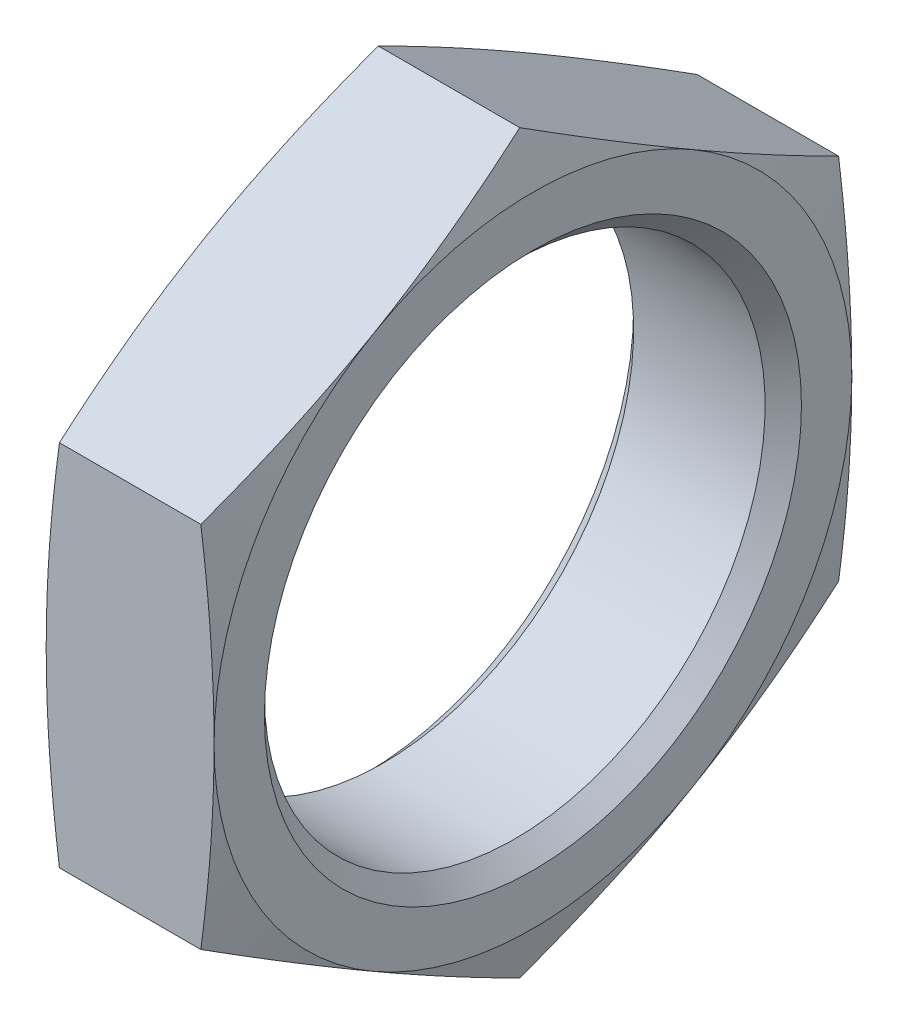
ISO-10303-21;
HEADER;
FILE_DESCRIPTION(('STEP AP214'),'2;1');
FILE_NAME('part.step','',(''),(''),'','','');
FILE_SCHEMA(('AUTOMOTIVE_DESIGN { 1 0 10303 214 1 1 1 1 }'));
ENDSEC;
DATA;
#1=APPLICATION_CONTEXT('core data for automotive mechanical design processes');
#2=APPLICATION_PROTOCOL_DEFINITION('international standard','automotive_design',2000,#1);
#3=PRODUCT_CONTEXT('',#1,'mechanical');
#4=PRODUCT('Part','Part','',(#3));
#5=PRODUCT_RELATED_PRODUCT_CATEGORY('part','',(#4));
#6=PRODUCT_DEFINITION_FORMATION('','',#4);
#7=PRODUCT_DEFINITION_CONTEXT('part definition',#1,'design');
#8=PRODUCT_DEFINITION('design','',#6,#7);
#9=PRODUCT_DEFINITION_SHAPE('','',#8);
#10=(LENGTH_UNIT() NAMED_UNIT(*) SI_UNIT(.MILLI.,.METRE.));
#11=(NAMED_UNIT(*) PLANE_ANGLE_UNIT() SI_UNIT($,.RADIAN.));
#12=(NAMED_UNIT(*) SI_UNIT($,.STERADIAN.) SOLID_ANGLE_UNIT());
#13=UNCERTAINTY_MEASURE_WITH_UNIT(LENGTH_MEASURE(1.E-05),#10,'distance_accuracy_value','');
#14=(GEOMETRIC_REPRESENTATION_CONTEXT(3) GLOBAL_UNCERTAINTY_ASSIGNED_CONTEXT((#13)) GLOBAL_UNIT_ASSIGNED_CONTEXT((#10,
#11,#12)) REPRESENTATION_CONTEXT('',''));
#15=CARTESIAN_POINT('',(0.,0.,0.));
#16=DIRECTION('',(0.,0.,1.));
#17=DIRECTION('',(1.,0.,0.));
#18=AXIS2_PLACEMENT_3D('',#15,#16,#17);
#19=CARTESIAN_POINT('',(1.0182069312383,0.,0.));
#20=DIRECTION('',(1.,0.,0.));
#21=DIRECTION('',(0.,0.,-1.));
#22=AXIS2_PLACEMENT_3D('',#19,#20,#21);
#23=CONICAL_SURFACE('',#22,13.3,1.30899693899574);
#24=CARTESIAN_POINT('',(0.393823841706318,-5.48471208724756,-9.5002));
#25=CARTESIAN_POINT('',(0.332765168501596,-5.71249277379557,-9.10567227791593));
#26=CARTESIAN_POINT('',(0.277334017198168,-5.94068644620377,-8.71042924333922));
#27=CARTESIAN_POINT('',(0.179946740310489,-6.39787965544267,-7.918547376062));
#28=CARTESIAN_POINT('',(0.137996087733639,-6.62687948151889,-7.52190804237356));
#29=CARTESIAN_POINT('',(0.0700188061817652,-7.08429660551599,-6.72963834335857));
#30=CARTESIAN_POINT('',(0.0439111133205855,-7.31271081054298,-6.33401333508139));
#31=CARTESIAN_POINT('',(0.00890337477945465,-7.76983049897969,-5.54225880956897));
#32=CARTESIAN_POINT('',(0.,-7.99853591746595,-5.14612940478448));
#33=CARTESIAN_POINT('',(0.,-8.45594675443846,-4.35387059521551));
#34=CARTESIAN_POINT('',(0.00890337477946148,-8.68465217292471,-3.95774119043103));
#35=CARTESIAN_POINT('',(0.043911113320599,-9.14177186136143,-3.16598666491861));
#36=CARTESIAN_POINT('',(0.070018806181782,-9.37018606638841,-2.77036165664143));
#37=CARTESIAN_POINT('',(0.137996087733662,-9.82760319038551,-1.97809195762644));
#38=CARTESIAN_POINT('',(0.179946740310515,-10.0566030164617,-1.581452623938));
#39=CARTESIAN_POINT('',(0.277334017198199,-10.5137962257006,-0.789570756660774));
#40=CARTESIAN_POINT('',(0.33276516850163,-10.7419898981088,-0.394327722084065));
#41=CARTESIAN_POINT('',(0.393823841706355,-10.9697705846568,0.000200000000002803));
#42=B_SPLINE_CURVE_WITH_KNOTS('',3,(#24,#25,#26,#27,#28,#29,#30,#31,#32,#33,#34,#35,#36,#37,#38,
#39,#40,#41),.UNSPECIFIED.,.F.,.F.,(4,2,2,2,2,2,2,2,4),(0.,1.3789772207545,2.75851359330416,
4.13093041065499,5.50308163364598,6.87523285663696,8.24764967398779,9.62718604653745,
11.006163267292),.UNSPECIFIED.);
#43=CARTESIAN_POINT('',(0.,-8.22724133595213,-4.75000000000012));
#44=VERTEX_POINT('',#43);
#45=CARTESIAN_POINT('',(0.393792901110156,-10.969655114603,0.));
#46=VERTEX_POINT('',#45);
#47=EDGE_CURVE('E200',#44,#46,#42,.T.);
#48=ORIENTED_EDGE('',*,*,#47,.T.);
#49=CARTESIAN_POINT('',(0.393823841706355,-10.9697705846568,-0.000199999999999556));
#50=CARTESIAN_POINT('',(0.33276516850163,-10.7419898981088,0.394327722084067));
#51=CARTESIAN_POINT('',(0.277334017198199,-10.5137962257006,0.789570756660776));
#52=CARTESIAN_POINT('',(0.179946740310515,-10.0566030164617,1.581452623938));
#53=CARTESIAN_POINT('',(0.137996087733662,-9.82760319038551,1.97809195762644));
#54=CARTESIAN_POINT('',(0.0700188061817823,-9.37018606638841,2.77036165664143));
#55=CARTESIAN_POINT('',(0.0439111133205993,-9.14177186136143,3.16598666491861));
#56=CARTESIAN_POINT('',(0.00890337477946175,-8.68465217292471,3.95774119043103));
#57=CARTESIAN_POINT('',(0.,-8.45594675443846,4.35387059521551));
#58=CARTESIAN_POINT('',(0.,-7.99853591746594,5.14612940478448));
#59=CARTESIAN_POINT('',(0.0089033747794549,-7.76983049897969,5.54225880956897));
#60=CARTESIAN_POINT('',(0.0439111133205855,-7.31271081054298,6.33401333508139));
#61=CARTESIAN_POINT('',(0.0700188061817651,-7.084296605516,6.72963834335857));
#62=CARTESIAN_POINT('',(0.137996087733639,-6.62687948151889,7.52190804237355));
#63=CARTESIAN_POINT('',(0.179946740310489,-6.39787965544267,7.918547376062));
#64=CARTESIAN_POINT('',(0.277334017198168,-5.94068644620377,8.71042924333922));
#65=CARTESIAN_POINT('',(0.332765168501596,-5.71249277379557,9.10567227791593));
#66=CARTESIAN_POINT('',(0.393823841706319,-5.48471208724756,9.5002));
#67=B_SPLINE_CURVE_WITH_KNOTS('',3,(#49,#50,#51,#52,#53,#54,#55,#56,#57,#58,#59,#60,#61,#62,#63,
#64,#65,#66),.UNSPECIFIED.,.F.,.F.,(4,2,2,2,2,2,2,2,4),(0.,1.3789772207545,2.75851359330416,
4.13093041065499,5.50308163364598,6.87523285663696,8.24764967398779,9.62718604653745,
11.006163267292),.UNSPECIFIED.);
#68=CARTESIAN_POINT('',(0.,-8.22724133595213,4.75000000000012));
#69=VERTEX_POINT('',#68);
#70=EDGE_CURVE('E218',#46,#69,#67,.T.);
#71=ORIENTED_EDGE('',*,*,#70,.T.);
#72=CARTESIAN_POINT('',(0.,0.,0.));
#73=DIRECTION('',(-1.,0.,0.));
#74=DIRECTION('',(0.,0.,1.));
#75=AXIS2_PLACEMENT_3D('',#72,#73,#74);
#76=CIRCLE('',#75,9.5);
#77=EDGE_CURVE('E278',#44,#69,#76,.T.);
#78=ORIENTED_EDGE('',*,*,#77,.F.);
#79=EDGE_LOOP('',(#48,#71,#78));
#80=FACE_BOUND('',#79,.T.);
#81=ADVANCED_FACE('F31',(#80),#23,.T.);
#82=CARTESIAN_POINT('',(0.,0.,9.5));
#83=VERTEX_POINT('',#82);
#84=EDGE_CURVE('E154',#69,#83,#76,.T.);
#85=ORIENTED_EDGE('',*,*,#84,.F.);
#86=CARTESIAN_POINT('',(0.39379290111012,-5.4848275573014,9.5));
#87=VERTEX_POINT('',#86);
#88=EDGE_CURVE('E205',#69,#87,#67,.T.);
#89=ORIENTED_EDGE('',*,*,#88,.T.);
#90=CARTESIAN_POINT('',(2.10970374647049,-14.5461077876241,9.5));
#91=CARTESIAN_POINT('',(2.01294628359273,-14.1146987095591,9.5));
#92=CARTESIAN_POINT('',(1.91736604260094,-13.6830208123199,9.5));
#93=CARTESIAN_POINT('',(1.72919550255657,-12.8189952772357,9.5));
#94=CARTESIAN_POINT('',(1.636605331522,-12.3866476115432,9.5));
#95=CARTESIAN_POINT('',(1.4549709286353,-11.5207683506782,9.5));
#96=CARTESIAN_POINT('',(1.36593021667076,-11.0872360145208,9.5));
#97=CARTESIAN_POINT('',(1.19234995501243,-10.2192716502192,9.5));
#98=CARTESIAN_POINT('',(1.10781036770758,-9.78483962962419,9.5));
#99=CARTESIAN_POINT('',(0.944956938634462,-8.91838541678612,9.5));
#100=CARTESIAN_POINT('',(0.866598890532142,-8.48637157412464,9.5));
#101=CARTESIAN_POINT('',(0.716681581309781,-7.62115649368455,9.5));
#102=CARTESIAN_POINT('',(0.64512234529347,-7.18795525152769,9.5));
#103=CARTESIAN_POINT('',(0.510409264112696,-6.32029337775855,9.5));
#104=CARTESIAN_POINT('',(0.447254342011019,-5.88583291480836,9.5));
#105=CARTESIAN_POINT('',(0.331203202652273,-5.0155282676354,9.5));
#106=CARTESIAN_POINT('',(0.278306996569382,-4.57968408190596,9.5));
#107=CARTESIAN_POINT('',(0.184263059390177,-3.70167921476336,9.5));
#108=CARTESIAN_POINT('',(0.143256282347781,-3.25950320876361,9.5));
#109=CARTESIAN_POINT('',(0.0758152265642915,-2.37403164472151,9.5));
#110=CARTESIAN_POINT('',(0.0493806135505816,-1.93073611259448,9.5));
#111=CARTESIAN_POINT('',(0.0126252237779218,-1.04366969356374,9.5));
#112=CARTESIAN_POINT('',(0.00229698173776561,-0.599899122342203,9.5));
#113=CARTESIAN_POINT('',(-0.00160982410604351,0.287716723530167,9.5));
#114=CARTESIAN_POINT('',(0.00481159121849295,0.731561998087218,9.5));
#115=CARTESIAN_POINT('',(0.0340433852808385,1.62032305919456,9.5));
#116=CARTESIAN_POINT('',(0.0569134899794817,2.06523684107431,9.5));
#117=CARTESIAN_POINT('',(0.117733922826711,2.95402294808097,9.5));
#118=CARTESIAN_POINT('',(0.155684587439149,3.39789524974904,9.5));
#119=CARTESIAN_POINT('',(0.244740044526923,4.2845939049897,9.5));
#120=CARTESIAN_POINT('',(0.295853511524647,4.72741937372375,9.5));
#121=CARTESIAN_POINT('',(0.409096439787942,5.61164372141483,9.5));
#122=CARTESIAN_POINT('',(0.471225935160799,6.0530425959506,9.5));
#123=CARTESIAN_POINT('',(0.600579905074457,6.90851654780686,9.5));
#124=CARTESIAN_POINT('',(0.667289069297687,7.32267033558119,9.5));
#125=CARTESIAN_POINT('',(0.807250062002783,8.14987638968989,9.5));
#126=CARTESIAN_POINT('',(0.880502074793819,8.56292862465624,9.5));
#127=CARTESIAN_POINT('',(1.03234492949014,9.38809006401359,9.5));
#128=CARTESIAN_POINT('',(1.11093632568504,9.80019916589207,9.5));
#129=CARTESIAN_POINT('',(1.27246601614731,10.6235574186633,9.5));
#130=CARTESIAN_POINT('',(1.3554042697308,11.0348065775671,9.5));
#131=CARTESIAN_POINT('',(1.5248571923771,11.8566718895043,9.5));
#132=CARTESIAN_POINT('',(1.61137274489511,12.2672878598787,9.5));
#133=CARTESIAN_POINT('',(1.78733417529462,13.0878923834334,9.5));
#134=CARTESIAN_POINT('',(1.87678007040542,13.4978809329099,9.5));
#135=CARTESIAN_POINT('',(2.14871662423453,14.7269901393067,9.5));
#136=CARTESIAN_POINT('',(2.33481810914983,15.5453115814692,9.5));
#137=CARTESIAN_POINT('',(2.71184671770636,17.1723071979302,9.5));
#138=CARTESIAN_POINT('',(2.90270792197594,17.9809967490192,9.5));
#139=CARTESIAN_POINT('',(3.28919263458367,19.597251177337,9.5));
#140=CARTESIAN_POINT('',(3.48481623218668,20.4048160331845,9.5));
#141=CARTESIAN_POINT('',(3.87932308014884,22.0180679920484,9.5));
#142=CARTESIAN_POINT('',(4.07820190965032,22.8237561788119,9.5));
#143=CARTESIAN_POINT('',(4.47865639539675,24.434433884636,9.5));
#144=CARTESIAN_POINT('',(4.68023196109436,25.2394234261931,9.5));
#145=CARTESIAN_POINT('',(4.88276117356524,26.0441702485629,9.5));
#146=B_SPLINE_CURVE_WITH_KNOTS('',3,(#90,#91,#92,#93,#94,#95,#96,#97,#98,#99,#100,#101,#102,
#103,#104,#105,#106,#107,#108,#109,#110,#111,#112,#113,#114,#115,#116,#117,#118,#119,#120,#121,
#122,#123,#124,#125,#126,#127,#128,#129,#130,#131,#132,#133,#134,#135,#136,#137,#138,#139,#140,
#141,#142,#143,#144,#145),.UNSPECIFIED.,.F.,.F.,(4,2,2,2,2,2,2,2,2,2,2,2,2,2,2,2,2,2,2,2,2,2,2,
2,2,2,2,4),(0.,1.3263847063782,2.65282612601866,3.98055177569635,5.30826632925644,
6.6254106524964,7.9425598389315,9.25954008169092,10.5765217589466,11.9085319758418,
13.2405116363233,14.5718737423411,15.9032341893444,17.2394534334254,18.575702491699,
19.9128344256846,21.2499704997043,22.5083841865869,23.7668333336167,25.0254133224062,
26.2839815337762,27.5428624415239,28.80175075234,31.3193519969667,33.8120568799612,
36.3048085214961,38.7944172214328,41.2839425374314),.UNSPECIFIED.);
#147=EDGE_CURVE('E217',#87,#83,#146,.T.);
#148=ORIENTED_EDGE('',*,*,#147,.T.);
#149=EDGE_LOOP('',(#85,#89,#148));
#150=FACE_BOUND('',#149,.T.);
#151=ADVANCED_FACE('F266',(#150),#23,.T.);
#152=CARTESIAN_POINT('',(0.,8.22724133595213,4.75000000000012));
#153=VERTEX_POINT('',#152);
#154=EDGE_CURVE('E152',#83,#153,#76,.T.);
#155=ORIENTED_EDGE('',*,*,#154,.F.);
#156=CARTESIAN_POINT('',(0.39379290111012,5.4848275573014,9.5));
#157=VERTEX_POINT('',#156);
#158=EDGE_CURVE('E211',#83,#157,#146,.T.);
#159=ORIENTED_EDGE('',*,*,#158,.T.);
#160=CARTESIAN_POINT('',(0.393823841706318,5.48471208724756,9.5002));
#161=CARTESIAN_POINT('',(0.332765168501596,5.71249277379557,9.10567227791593));
#162=CARTESIAN_POINT('',(0.277334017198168,5.94068644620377,8.71042924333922));
#163=CARTESIAN_POINT('',(0.179946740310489,6.39787965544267,7.918547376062));
#164=CARTESIAN_POINT('',(0.137996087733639,6.62687948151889,7.52190804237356));
#165=CARTESIAN_POINT('',(0.0700188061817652,7.08429660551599,6.72963834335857));
#166=CARTESIAN_POINT('',(0.0439111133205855,7.31271081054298,6.33401333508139));
#167=CARTESIAN_POINT('',(0.00890337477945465,7.76983049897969,5.54225880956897));
#168=CARTESIAN_POINT('',(0.,7.99853591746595,5.14612940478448));
#169=CARTESIAN_POINT('',(0.,8.45594675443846,4.35387059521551));
#170=CARTESIAN_POINT('',(0.00890337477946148,8.68465217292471,3.95774119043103));
#171=CARTESIAN_POINT('',(0.043911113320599,9.14177186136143,3.16598666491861));
#172=CARTESIAN_POINT('',(0.070018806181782,9.37018606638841,2.77036165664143));
#173=CARTESIAN_POINT('',(0.137996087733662,9.82760319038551,1.97809195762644));
#174=CARTESIAN_POINT('',(0.179946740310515,10.0566030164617,1.581452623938));
#175=CARTESIAN_POINT('',(0.277334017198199,10.5137962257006,0.789570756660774));
#176=CARTESIAN_POINT('',(0.33276516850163,10.7419898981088,0.394327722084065));
#177=CARTESIAN_POINT('',(0.393823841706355,10.9697705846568,-0.000200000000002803));
#178=B_SPLINE_CURVE_WITH_KNOTS('',3,(#160,#161,#162,#163,#164,#165,#166,#167,#168,#169,#170,
#171,#172,#173,#174,#175,#176,#177),.UNSPECIFIED.,.F.,.F.,(4,2,2,2,2,2,2,2,4),(0.,
1.3789772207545,2.75851359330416,4.13093041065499,5.50308163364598,6.87523285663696,
8.24764967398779,9.62718604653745,11.006163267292),.UNSPECIFIED.);
#179=EDGE_CURVE('E305',#157,#153,#178,.T.);
#180=ORIENTED_EDGE('',*,*,#179,.T.);
#181=EDGE_LOOP('',(#155,#159,#180));
#182=FACE_BOUND('',#181,.T.);
#183=ADVANCED_FACE('F271',(#182),#23,.T.);
#184=CARTESIAN_POINT('',(2.10970374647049,-14.5461077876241,-9.5));
#185=CARTESIAN_POINT('',(2.01294628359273,-14.1146987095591,-9.5));
#186=CARTESIAN_POINT('',(1.91736604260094,-13.6830208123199,-9.5));
#187=CARTESIAN_POINT('',(1.72919550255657,-12.8189952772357,-9.5));
#188=CARTESIAN_POINT('',(1.636605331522,-12.3866476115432,-9.5));
#189=CARTESIAN_POINT('',(1.4549709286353,-11.5207683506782,-9.5));
#190=CARTESIAN_POINT('',(1.36593021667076,-11.0872360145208,-9.5));
#191=CARTESIAN_POINT('',(1.19234995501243,-10.2192716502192,-9.5));
#192=CARTESIAN_POINT('',(1.10781036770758,-9.78483962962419,-9.5));
#193=CARTESIAN_POINT('',(0.944956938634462,-8.91838541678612,-9.5));
#194=CARTESIAN_POINT('',(0.866598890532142,-8.48637157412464,-9.5));
#195=CARTESIAN_POINT('',(0.716681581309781,-7.62115649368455,-9.5));
#196=CARTESIAN_POINT('',(0.64512234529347,-7.18795525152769,-9.5));
#197=CARTESIAN_POINT('',(0.510409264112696,-6.32029337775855,-9.5));
#198=CARTESIAN_POINT('',(0.447254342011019,-5.88583291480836,-9.5));
#199=CARTESIAN_POINT('',(0.331203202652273,-5.0155282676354,-9.5));
#200=CARTESIAN_POINT('',(0.278306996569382,-4.57968408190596,-9.5));
#201=CARTESIAN_POINT('',(0.184263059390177,-3.70167921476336,-9.5));
#202=CARTESIAN_POINT('',(0.143256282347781,-3.25950320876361,-9.5));
#203=CARTESIAN_POINT('',(0.0758152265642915,-2.37403164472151,-9.5));
#204=CARTESIAN_POINT('',(0.0493806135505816,-1.93073611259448,-9.5));
#205=CARTESIAN_POINT('',(0.0126252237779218,-1.04366969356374,-9.5));
#206=CARTESIAN_POINT('',(0.00229698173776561,-0.599899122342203,-9.5));
#207=CARTESIAN_POINT('',(-0.00160982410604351,0.287716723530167,-9.5));
#208=CARTESIAN_POINT('',(0.00481159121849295,0.731561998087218,-9.5));
#209=CARTESIAN_POINT('',(0.0340433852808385,1.62032305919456,-9.5));
#210=CARTESIAN_POINT('',(0.0569134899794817,2.06523684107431,-9.5));
#211=CARTESIAN_POINT('',(0.117733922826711,2.95402294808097,-9.5));
#212=CARTESIAN_POINT('',(0.155684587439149,3.39789524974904,-9.5));
#213=CARTESIAN_POINT('',(0.244740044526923,4.2845939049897,-9.5));
#214=CARTESIAN_POINT('',(0.295853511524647,4.72741937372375,-9.5));
#215=CARTESIAN_POINT('',(0.409096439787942,5.61164372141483,-9.5));
#216=CARTESIAN_POINT('',(0.471225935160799,6.0530425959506,-9.5));
#217=CARTESIAN_POINT('',(0.600579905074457,6.90851654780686,-9.5));
#218=CARTESIAN_POINT('',(0.667289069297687,7.32267033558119,-9.5));
#219=CARTESIAN_POINT('',(0.807250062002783,8.14987638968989,-9.5));
#220=CARTESIAN_POINT('',(0.880502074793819,8.56292862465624,-9.5));
#221=CARTESIAN_POINT('',(1.03234492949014,9.38809006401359,-9.5));
#222=CARTESIAN_POINT('',(1.11093632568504,9.80019916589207,-9.5));
#223=CARTESIAN_POINT('',(1.27246601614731,10.6235574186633,-9.5));
#224=CARTESIAN_POINT('',(1.3554042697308,11.0348065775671,-9.5));
#225=CARTESIAN_POINT('',(1.5248571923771,11.8566718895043,-9.5));
#226=CARTESIAN_POINT('',(1.61137274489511,12.2672878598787,-9.5));
#227=CARTESIAN_POINT('',(1.78733417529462,13.0878923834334,-9.5));
#228=CARTESIAN_POINT('',(1.87678007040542,13.4978809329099,-9.5));
#229=CARTESIAN_POINT('',(2.14871662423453,14.7269901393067,-9.5));
#230=CARTESIAN_POINT('',(2.33481810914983,15.5453115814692,-9.5));
#231=CARTESIAN_POINT('',(2.71184671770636,17.1723071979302,-9.5));
#232=CARTESIAN_POINT('',(2.90270792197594,17.9809967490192,-9.5));
#233=CARTESIAN_POINT('',(3.28919263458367,19.597251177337,-9.5));
#234=CARTESIAN_POINT('',(3.48481623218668,20.4048160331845,-9.5));
#235=CARTESIAN_POINT('',(3.87932308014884,22.0180679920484,-9.5));
#236=CARTESIAN_POINT('',(4.07820190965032,22.8237561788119,-9.5));
#237=CARTESIAN_POINT('',(4.47865639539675,24.434433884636,-9.5));
#238=CARTESIAN_POINT('',(4.68023196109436,25.2394234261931,-9.5));
#239=CARTESIAN_POINT('',(4.88276117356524,26.0441702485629,-9.5));
#240=B_SPLINE_CURVE_WITH_KNOTS('',3,(#184,#185,#186,#187,#188,#189,#190,#191,#192,#193,#194,
#195,#196,#197,#198,#199,#200,#201,#202,#203,#204,#205,#206,#207,#208,#209,#210,#211,#212,#213,
#214,#215,#216,#217,#218,#219,#220,#221,#222,#223,#224,#225,#226,#227,#228,#229,#230,#231,#232,
#233,#234,#235,#236,#237,#238,#239),.UNSPECIFIED.,.F.,.F.,(4,2,2,2,2,2,2,2,2,2,2,2,2,2,2,2,2,2,
2,2,2,2,2,2,2,2,2,4),(0.,1.3263847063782,2.65282612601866,3.98055177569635,5.30826632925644,
6.6254106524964,7.9425598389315,9.25954008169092,10.5765217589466,11.9085319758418,
13.2405116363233,14.5718737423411,15.9032341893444,17.2394534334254,18.575702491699,
19.9128344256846,21.2499704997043,22.5083841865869,23.7668333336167,25.0254133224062,
26.2839815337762,27.5428624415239,28.80175075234,31.3193519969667,33.8120568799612,
36.3048085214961,38.7944172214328,41.2839425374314),.UNSPECIFIED.);
#241=CARTESIAN_POINT('',(0.,0.,-9.5));
#242=VERTEX_POINT('',#241);
#243=CARTESIAN_POINT('',(0.39379290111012,-5.4848275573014,-9.5));
#244=VERTEX_POINT('',#243);
#245=EDGE_CURVE('E139',#242,#244,#240,.F.);
#246=ORIENTED_EDGE('',*,*,#245,.T.);
#247=EDGE_CURVE('E281',#244,#44,#42,.T.);
#248=ORIENTED_EDGE('',*,*,#247,.T.);
#249=EDGE_CURVE('E147',#242,#44,#76,.T.);
#250=ORIENTED_EDGE('',*,*,#249,.F.);
#251=EDGE_LOOP('',(#246,#248,#250));
#252=FACE_BOUND('',#251,.T.);
#253=ADVANCED_FACE('F284',(#252),#23,.T.);
#254=CARTESIAN_POINT('',(0.,8.22724133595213,-4.75000000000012));
#255=VERTEX_POINT('',#254);
#256=EDGE_CURVE('E136',#153,#255,#76,.T.);
#257=ORIENTED_EDGE('',*,*,#256,.F.);
#258=CARTESIAN_POINT('',(0.393792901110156,10.969655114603,0.));
#259=VERTEX_POINT('',#258);
#260=EDGE_CURVE('E138',#153,#259,#178,.T.);
#261=ORIENTED_EDGE('',*,*,#260,.T.);
#262=CARTESIAN_POINT('',(0.393823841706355,10.9697705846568,0.000199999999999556));
#263=CARTESIAN_POINT('',(0.33276516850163,10.7419898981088,-0.394327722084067));
#264=CARTESIAN_POINT('',(0.277334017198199,10.5137962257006,-0.789570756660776));
#265=CARTESIAN_POINT('',(0.179946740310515,10.0566030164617,-1.581452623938));
#266=CARTESIAN_POINT('',(0.137996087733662,9.82760319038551,-1.97809195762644));
#267=CARTESIAN_POINT('',(0.0700188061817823,9.37018606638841,-2.77036165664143));
#268=CARTESIAN_POINT('',(0.0439111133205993,9.14177186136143,-3.16598666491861));
#269=CARTESIAN_POINT('',(0.00890337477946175,8.68465217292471,-3.95774119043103));
#270=CARTESIAN_POINT('',(0.,8.45594675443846,-4.35387059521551));
#271=CARTESIAN_POINT('',(0.,7.99853591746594,-5.14612940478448));
#272=CARTESIAN_POINT('',(0.0089033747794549,7.76983049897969,-5.54225880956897));
#273=CARTESIAN_POINT('',(0.0439111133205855,7.31271081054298,-6.33401333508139));
#274=CARTESIAN_POINT('',(0.0700188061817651,7.084296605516,-6.72963834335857));
#275=CARTESIAN_POINT('',(0.137996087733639,6.62687948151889,-7.52190804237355));
#276=CARTESIAN_POINT('',(0.179946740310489,6.39787965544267,-7.918547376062));
#277=CARTESIAN_POINT('',(0.277334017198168,5.94068644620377,-8.71042924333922));
#278=CARTESIAN_POINT('',(0.332765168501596,5.71249277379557,-9.10567227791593));
#279=CARTESIAN_POINT('',(0.393823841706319,5.48471208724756,-9.5002));
#280=B_SPLINE_CURVE_WITH_KNOTS('',3,(#262,#263,#264,#265,#266,#267,#268,#269,#270,#271,#272,
#273,#274,#275,#276,#277,#278,#279),.UNSPECIFIED.,.F.,.F.,(4,2,2,2,2,2,2,2,4),(0.,
1.3789772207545,2.75851359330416,4.13093041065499,5.50308163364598,6.87523285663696,
8.24764967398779,9.62718604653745,11.006163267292),.UNSPECIFIED.);
#281=EDGE_CURVE('E125',#259,#255,#280,.T.);
#282=ORIENTED_EDGE('',*,*,#281,.T.);
#283=EDGE_LOOP('',(#257,#261,#282));
#284=FACE_BOUND('',#283,.T.);
#285=ADVANCED_FACE('F134',(#284),#23,.T.);
#286=CARTESIAN_POINT('',(5.,0.,0.));
#287=DIRECTION('',(-1.,0.,0.));
#288=DIRECTION('',(0.,0.,1.));
#289=AXIS2_PLACEMENT_3D('',#286,#287,#288);
#290=CONICAL_SURFACE('',#289,9.5,1.30899693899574);
#291=CARTESIAN_POINT('',(4.60617615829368,5.48471208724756,-9.5002));
#292=CARTESIAN_POINT('',(4.6672348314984,5.71249277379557,-9.10567227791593));
#293=CARTESIAN_POINT('',(4.72266598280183,5.94068644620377,-8.71042924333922));
#294=CARTESIAN_POINT('',(4.82005325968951,6.39787965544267,-7.918547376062));
#295=CARTESIAN_POINT('',(4.86200391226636,6.62687948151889,-7.52190804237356));
#296=CARTESIAN_POINT('',(4.92998119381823,7.08429660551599,-6.72963834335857));
#297=CARTESIAN_POINT('',(4.95608888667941,7.31271081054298,-6.33401333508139));
#298=CARTESIAN_POINT('',(4.99109662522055,7.76983049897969,-5.54225880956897));
#299=CARTESIAN_POINT('',(4.99999999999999,7.99853591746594,-5.14612940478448));
#300=CARTESIAN_POINT('',(4.99999999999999,8.45594675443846,-4.35387059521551));
#301=CARTESIAN_POINT('',(4.99109662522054,8.68465217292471,-3.95774119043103));
#302=CARTESIAN_POINT('',(4.9560888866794,9.14177186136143,-3.16598666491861));
#303=CARTESIAN_POINT('',(4.92998119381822,9.37018606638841,-2.77036165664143));
#304=CARTESIAN_POINT('',(4.86200391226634,9.82760319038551,-1.97809195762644));
#305=CARTESIAN_POINT('',(4.82005325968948,10.0566030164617,-1.581452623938));
#306=CARTESIAN_POINT('',(4.7226659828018,10.5137962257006,-0.789570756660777));
#307=CARTESIAN_POINT('',(4.66723483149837,10.7419898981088,-0.394327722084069));
#308=CARTESIAN_POINT('',(4.60617615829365,10.9697705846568,0.000199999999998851));
#309=B_SPLINE_CURVE_WITH_KNOTS('',3,(#291,#292,#293,#294,#295,#296,#297,#298,#299,#300,#301,
#302,#303,#304,#305,#306,#307,#308),.UNSPECIFIED.,.F.,.F.,(4,2,2,2,2,2,2,2,4),(0.,
1.3789772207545,2.75851359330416,4.13093041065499,5.50308163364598,6.87523285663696,
8.24764967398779,9.62718604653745,11.006163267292),.UNSPECIFIED.);
#310=CARTESIAN_POINT('',(5.,8.22724133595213,-4.75000000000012));
#311=VERTEX_POINT('',#310);
#312=CARTESIAN_POINT('',(4.60620709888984,10.969655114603,0.));
#313=VERTEX_POINT('',#312);
#314=EDGE_CURVE('E153',#311,#313,#309,.T.);
#315=ORIENTED_EDGE('',*,*,#314,.T.);
#316=CARTESIAN_POINT('',(4.60617615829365,10.9697705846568,-0.000200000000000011));
#317=CARTESIAN_POINT('',(4.66723483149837,10.7419898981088,0.394327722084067));
#318=CARTESIAN_POINT('',(4.7226659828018,10.5137962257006,0.789570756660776));
#319=CARTESIAN_POINT('',(4.82005325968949,10.0566030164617,1.581452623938));
#320=CARTESIAN_POINT('',(4.86200391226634,9.82760319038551,1.97809195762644));
#321=CARTESIAN_POINT('',(4.92998119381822,9.37018606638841,2.77036165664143));
#322=CARTESIAN_POINT('',(4.9560888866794,9.14177186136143,3.16598666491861));
#323=CARTESIAN_POINT('',(4.99109662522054,8.68465217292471,3.95774119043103));
#324=CARTESIAN_POINT('',(4.99999999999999,8.45594675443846,4.35387059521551));
#325=CARTESIAN_POINT('',(4.99999999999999,7.99853591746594,5.14612940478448));
#326=CARTESIAN_POINT('',(4.99109662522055,7.76983049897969,5.54225880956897));
#327=CARTESIAN_POINT('',(4.95608888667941,7.31271081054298,6.33401333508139));
#328=CARTESIAN_POINT('',(4.92998119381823,7.08429660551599,6.72963834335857));
#329=CARTESIAN_POINT('',(4.86200391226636,6.62687948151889,7.52190804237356));
#330=CARTESIAN_POINT('',(4.82005325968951,6.39787965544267,7.918547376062));
#331=CARTESIAN_POINT('',(4.72266598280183,5.94068644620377,8.71042924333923));
#332=CARTESIAN_POINT('',(4.6672348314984,5.71249277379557,9.10567227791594));
#333=CARTESIAN_POINT('',(4.60617615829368,5.48471208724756,9.5002));
#334=B_SPLINE_CURVE_WITH_KNOTS('',3,(#316,#317,#318,#319,#320,#321,#322,#323,#324,#325,#326,
#327,#328,#329,#330,#331,#332,#333),.UNSPECIFIED.,.F.,.F.,(4,2,2,2,2,2,2,2,4),(0.,
1.3789772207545,2.75851359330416,4.13093041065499,5.50308163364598,6.87523285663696,
8.2476496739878,9.62718604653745,11.006163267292),.UNSPECIFIED.);
#335=CARTESIAN_POINT('',(5.,8.22724133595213,4.75000000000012));
#336=VERTEX_POINT('',#335);
#337=EDGE_CURVE('E11',#313,#336,#334,.T.);
#338=ORIENTED_EDGE('',*,*,#337,.T.);
#339=CARTESIAN_POINT('',(5.,0.,0.));
#340=DIRECTION('',(-1.,0.,0.));
#341=DIRECTION('',(0.,0.,1.));
#342=AXIS2_PLACEMENT_3D('',#339,#340,#341);
#343=CIRCLE('',#342,9.5);
#344=EDGE_CURVE('E310',#336,#311,#343,.T.);
#345=ORIENTED_EDGE('',*,*,#344,.T.);
#346=EDGE_LOOP('',(#315,#338,#345));
#347=FACE_BOUND('',#346,.T.);
#348=ADVANCED_FACE('F361',(#347),#290,.T.);
#349=CARTESIAN_POINT('',(5.,0.,9.5));
#350=VERTEX_POINT('',#349);
#351=EDGE_CURVE('E157',#350,#336,#343,.T.);
#352=ORIENTED_EDGE('',*,*,#351,.T.);
#353=CARTESIAN_POINT('',(4.60620709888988,5.4848275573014,9.5));
#354=VERTEX_POINT('',#353);
#355=EDGE_CURVE('E35',#336,#354,#334,.T.);
#356=ORIENTED_EDGE('',*,*,#355,.T.);
#357=CARTESIAN_POINT('',(2.89029625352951,-14.5461077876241,9.5));
#358=CARTESIAN_POINT('',(2.98705371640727,-14.1146987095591,9.5));
#359=CARTESIAN_POINT('',(3.08263395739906,-13.6830208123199,9.5));
#360=CARTESIAN_POINT('',(3.27080449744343,-12.8189952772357,9.5));
#361=CARTESIAN_POINT('',(3.363394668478,-12.3866476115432,9.5));
#362=CARTESIAN_POINT('',(3.5450290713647,-11.5207683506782,9.5));
#363=CARTESIAN_POINT('',(3.63406978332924,-11.0872360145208,9.5));
#364=CARTESIAN_POINT('',(3.80765004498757,-10.2192716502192,9.5));
#365=CARTESIAN_POINT('',(3.89218963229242,-9.78483962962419,9.5));
#366=CARTESIAN_POINT('',(4.05504306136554,-8.91838541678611,9.5));
#367=CARTESIAN_POINT('',(4.13340110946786,-8.48637157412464,9.5));
#368=CARTESIAN_POINT('',(4.28331841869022,-7.62115649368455,9.5));
#369=CARTESIAN_POINT('',(4.35487765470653,-7.18795525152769,9.5));
#370=CARTESIAN_POINT('',(4.4895907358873,-6.32029337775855,9.5));
#371=CARTESIAN_POINT('',(4.55274565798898,-5.88583291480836,9.5));
#372=CARTESIAN_POINT('',(4.66879679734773,-5.0155282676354,9.5));
#373=CARTESIAN_POINT('',(4.72169300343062,-4.57968408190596,9.5));
#374=CARTESIAN_POINT('',(4.81573694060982,-3.70167921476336,9.5));
#375=CARTESIAN_POINT('',(4.85674371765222,-3.25950320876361,9.5));
#376=CARTESIAN_POINT('',(4.92418477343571,-2.37403164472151,9.5));
#377=CARTESIAN_POINT('',(4.95061938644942,-1.93073611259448,9.5));
#378=CARTESIAN_POINT('',(4.98737477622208,-1.04366969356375,9.5));
#379=CARTESIAN_POINT('',(4.99770301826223,-0.599899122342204,9.5));
#380=CARTESIAN_POINT('',(5.00160982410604,0.287716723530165,9.5));
#381=CARTESIAN_POINT('',(4.99518840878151,0.731561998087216,9.5));
#382=CARTESIAN_POINT('',(4.96595661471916,1.62032305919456,9.5));
#383=CARTESIAN_POINT('',(4.94308651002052,2.06523684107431,9.5));
#384=CARTESIAN_POINT('',(4.88226607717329,2.95402294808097,9.5));
#385=CARTESIAN_POINT('',(4.84431541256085,3.39789524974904,9.5));
#386=CARTESIAN_POINT('',(4.75525995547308,4.28459390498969,9.5));
#387=CARTESIAN_POINT('',(4.70414648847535,4.72741937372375,9.5));
#388=CARTESIAN_POINT('',(4.59090356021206,5.61164372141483,9.5));
#389=CARTESIAN_POINT('',(4.5287740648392,6.0530425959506,9.5));
#390=CARTESIAN_POINT('',(4.39942009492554,6.90851654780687,9.5));
#391=CARTESIAN_POINT('',(4.33271093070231,7.3226703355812,9.5));
#392=CARTESIAN_POINT('',(4.19274993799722,8.14987638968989,9.5));
#393=CARTESIAN_POINT('',(4.11949792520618,8.56292862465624,9.5));
#394=CARTESIAN_POINT('',(3.96765507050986,9.3880900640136,9.5));
#395=CARTESIAN_POINT('',(3.88906367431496,9.80019916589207,9.5));
#396=CARTESIAN_POINT('',(3.72753398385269,10.6235574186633,9.5));
#397=CARTESIAN_POINT('',(3.6445957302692,11.0348065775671,9.5));
#398=CARTESIAN_POINT('',(3.4751428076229,11.8566718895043,9.5));
#399=CARTESIAN_POINT('',(3.38862725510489,12.2672878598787,9.5));
#400=CARTESIAN_POINT('',(3.21266582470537,13.0878923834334,9.5));
#401=CARTESIAN_POINT('',(3.12321992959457,13.4978809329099,9.5));
#402=CARTESIAN_POINT('',(2.85128337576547,14.7269901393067,9.5));
#403=CARTESIAN_POINT('',(2.66518189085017,15.5453115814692,9.5));
#404=CARTESIAN_POINT('',(2.28815328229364,17.1723071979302,9.5));
#405=CARTESIAN_POINT('',(2.09729207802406,17.9809967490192,9.5));
#406=CARTESIAN_POINT('',(1.71080736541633,19.597251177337,9.5));
#407=CARTESIAN_POINT('',(1.51518376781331,20.4048160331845,9.5));
#408=CARTESIAN_POINT('',(1.12067691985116,22.0180679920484,9.5));
#409=CARTESIAN_POINT('',(0.921798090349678,22.8237561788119,9.5));
#410=CARTESIAN_POINT('',(0.521343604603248,24.434433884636,9.5));
#411=CARTESIAN_POINT('',(0.319768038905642,25.2394234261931,9.5));
#412=CARTESIAN_POINT('',(0.117238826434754,26.044170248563,9.5));
#413=B_SPLINE_CURVE_WITH_KNOTS('',3,(#357,#358,#359,#360,#361,#362,#363,#364,#365,#366,#367,
#368,#369,#370,#371,#372,#373,#374,#375,#376,#377,#378,#379,#380,#381,#382,#383,#384,#385,#386,
#387,#388,#389,#390,#391,#392,#393,#394,#395,#396,#397,#398,#399,#400,#401,#402,#403,#404,#405,
#406,#407,#408,#409,#410,#411,#412),.UNSPECIFIED.,.F.,.F.,(4,2,2,2,2,2,2,2,2,2,2,2,2,2,2,2,2,2,
2,2,2,2,2,2,2,2,2,4),(0.,1.3263847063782,2.65282612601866,3.98055177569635,5.30826632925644,
6.6254106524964,7.9425598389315,9.25954008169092,10.5765217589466,11.9085319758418,
13.2405116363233,14.5718737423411,15.9032341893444,17.2394534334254,18.575702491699,
19.9128344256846,21.2499704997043,22.5083841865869,23.7668333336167,25.0254133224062,
26.2839815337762,27.5428624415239,28.80175075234,31.3193519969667,33.8120568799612,
36.3048085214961,38.7944172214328,41.2839425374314),.UNSPECIFIED.);
#414=EDGE_CURVE('E239',#354,#350,#413,.F.);
#415=ORIENTED_EDGE('',*,*,#414,.T.);
#416=EDGE_LOOP('',(#352,#356,#415));
#417=FACE_BOUND('',#416,.T.);
#418=ADVANCED_FACE('F362',(#417),#290,.T.);
#419=CARTESIAN_POINT('',(5.,-8.22724133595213,4.75000000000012));
#420=VERTEX_POINT('',#419);
#421=EDGE_CURVE('E311',#420,#350,#343,.T.);
#422=ORIENTED_EDGE('',*,*,#421,.T.);
#423=CARTESIAN_POINT('',(4.60620709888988,-5.4848275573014,9.5));
#424=VERTEX_POINT('',#423);
#425=EDGE_CURVE('E233',#350,#424,#413,.F.);
#426=ORIENTED_EDGE('',*,*,#425,.T.);
#427=CARTESIAN_POINT('',(4.60617615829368,-5.48471208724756,9.5002));
#428=CARTESIAN_POINT('',(4.6672348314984,-5.71249277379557,9.10567227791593));
#429=CARTESIAN_POINT('',(4.72266598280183,-5.94068644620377,8.71042924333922));
#430=CARTESIAN_POINT('',(4.82005325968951,-6.39787965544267,7.918547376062));
#431=CARTESIAN_POINT('',(4.86200391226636,-6.62687948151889,7.52190804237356));
#432=CARTESIAN_POINT('',(4.92998119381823,-7.08429660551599,6.72963834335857));
#433=CARTESIAN_POINT('',(4.95608888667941,-7.31271081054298,6.33401333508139));
#434=CARTESIAN_POINT('',(4.99109662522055,-7.76983049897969,5.54225880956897));
#435=CARTESIAN_POINT('',(4.99999999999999,-7.99853591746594,5.14612940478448));
#436=CARTESIAN_POINT('',(4.99999999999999,-8.45594675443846,4.35387059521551));
#437=CARTESIAN_POINT('',(4.99109662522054,-8.68465217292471,3.95774119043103));
#438=CARTESIAN_POINT('',(4.9560888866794,-9.14177186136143,3.16598666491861));
#439=CARTESIAN_POINT('',(4.92998119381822,-9.37018606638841,2.77036165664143));
#440=CARTESIAN_POINT('',(4.86200391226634,-9.82760319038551,1.97809195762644));
#441=CARTESIAN_POINT('',(4.82005325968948,-10.0566030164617,1.581452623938));
#442=CARTESIAN_POINT('',(4.7226659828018,-10.5137962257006,0.789570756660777));
#443=CARTESIAN_POINT('',(4.66723483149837,-10.7419898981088,0.394327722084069));
#444=CARTESIAN_POINT('',(4.60617615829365,-10.9697705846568,-0.000199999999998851));
#445=B_SPLINE_CURVE_WITH_KNOTS('',3,(#427,#428,#429,#430,#431,#432,#433,#434,#435,#436,#437,
#438,#439,#440,#441,#442,#443,#444),.UNSPECIFIED.,.F.,.F.,(4,2,2,2,2,2,2,2,4),(0.,
1.3789772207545,2.75851359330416,4.13093041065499,5.50308163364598,6.87523285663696,
8.24764967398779,9.62718604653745,11.006163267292),.UNSPECIFIED.);
#446=EDGE_CURVE('E240',#424,#420,#445,.T.);
#447=ORIENTED_EDGE('',*,*,#446,.T.);
#448=EDGE_LOOP('',(#422,#426,#447));
#449=FACE_BOUND('',#448,.T.);
#450=ADVANCED_FACE('F364',(#449),#290,.T.);
#451=CARTESIAN_POINT('',(5.,-8.22724133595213,-4.75000000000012));
#452=VERTEX_POINT('',#451);
#453=EDGE_CURVE('E317',#452,#420,#343,.T.);
#454=ORIENTED_EDGE('',*,*,#453,.T.);
#455=CARTESIAN_POINT('',(4.60620709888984,-10.969655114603,0.));
#456=VERTEX_POINT('',#455);
#457=EDGE_CURVE('E241',#420,#456,#445,.T.);
#458=ORIENTED_EDGE('',*,*,#457,.T.);
#459=CARTESIAN_POINT('',(4.60617615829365,-10.9697705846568,0.000200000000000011));
#460=CARTESIAN_POINT('',(4.66723483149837,-10.7419898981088,-0.394327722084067));
#461=CARTESIAN_POINT('',(4.7226659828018,-10.5137962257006,-0.789570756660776));
#462=CARTESIAN_POINT('',(4.82005325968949,-10.0566030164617,-1.581452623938));
#463=CARTESIAN_POINT('',(4.86200391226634,-9.82760319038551,-1.97809195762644));
#464=CARTESIAN_POINT('',(4.92998119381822,-9.37018606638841,-2.77036165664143));
#465=CARTESIAN_POINT('',(4.9560888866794,-9.14177186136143,-3.16598666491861));
#466=CARTESIAN_POINT('',(4.99109662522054,-8.68465217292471,-3.95774119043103));
#467=CARTESIAN_POINT('',(4.99999999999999,-8.45594675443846,-4.35387059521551));
#468=CARTESIAN_POINT('',(4.99999999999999,-7.99853591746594,-5.14612940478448));
#469=CARTESIAN_POINT('',(4.99109662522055,-7.76983049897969,-5.54225880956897));
#470=CARTESIAN_POINT('',(4.95608888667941,-7.31271081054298,-6.33401333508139));
#471=CARTESIAN_POINT('',(4.92998119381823,-7.08429660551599,-6.72963834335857));
#472=CARTESIAN_POINT('',(4.86200391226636,-6.62687948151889,-7.52190804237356));
#473=CARTESIAN_POINT('',(4.82005325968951,-6.39787965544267,-7.918547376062));
#474=CARTESIAN_POINT('',(4.72266598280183,-5.94068644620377,-8.71042924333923));
#475=CARTESIAN_POINT('',(4.6672348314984,-5.71249277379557,-9.10567227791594));
#476=CARTESIAN_POINT('',(4.60617615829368,-5.48471208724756,-9.5002));
#477=B_SPLINE_CURVE_WITH_KNOTS('',3,(#459,#460,#461,#462,#463,#464,#465,#466,#467,#468,#469,
#470,#471,#472,#473,#474,#475,#476),.UNSPECIFIED.,.F.,.F.,(4,2,2,2,2,2,2,2,4),(0.,
1.3789772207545,2.75851359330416,4.13093041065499,5.50308163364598,6.87523285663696,
8.2476496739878,9.62718604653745,11.006163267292),.UNSPECIFIED.);
#478=EDGE_CURVE('E246',#456,#452,#477,.T.);
#479=ORIENTED_EDGE('',*,*,#478,.T.);
#480=EDGE_LOOP('',(#454,#458,#479));
#481=FACE_BOUND('',#480,.T.);
#482=ADVANCED_FACE('F369',(#481),#290,.T.);
#483=CARTESIAN_POINT('',(5.,0.,-9.5));
#484=VERTEX_POINT('',#483);
#485=EDGE_CURVE('E323',#484,#452,#343,.T.);
#486=ORIENTED_EDGE('',*,*,#485,.T.);
#487=CARTESIAN_POINT('',(4.60620709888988,-5.4848275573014,-9.5));
#488=VERTEX_POINT('',#487);
#489=EDGE_CURVE('E247',#452,#488,#477,.T.);
#490=ORIENTED_EDGE('',*,*,#489,.T.);
#491=CARTESIAN_POINT('',(2.89029625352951,-14.5461077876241,-9.5));
#492=CARTESIAN_POINT('',(2.98705371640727,-14.1146987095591,-9.5));
#493=CARTESIAN_POINT('',(3.08263395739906,-13.6830208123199,-9.5));
#494=CARTESIAN_POINT('',(3.27080449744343,-12.8189952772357,-9.5));
#495=CARTESIAN_POINT('',(3.363394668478,-12.3866476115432,-9.5));
#496=CARTESIAN_POINT('',(3.5450290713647,-11.5207683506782,-9.5));
#497=CARTESIAN_POINT('',(3.63406978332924,-11.0872360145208,-9.5));
#498=CARTESIAN_POINT('',(3.80765004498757,-10.2192716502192,-9.5));
#499=CARTESIAN_POINT('',(3.89218963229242,-9.78483962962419,-9.5));
#500=CARTESIAN_POINT('',(4.05504306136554,-8.91838541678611,-9.5));
#501=CARTESIAN_POINT('',(4.13340110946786,-8.48637157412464,-9.5));
#502=CARTESIAN_POINT('',(4.28331841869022,-7.62115649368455,-9.5));
#503=CARTESIAN_POINT('',(4.35487765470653,-7.18795525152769,-9.5));
#504=CARTESIAN_POINT('',(4.4895907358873,-6.32029337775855,-9.5));
#505=CARTESIAN_POINT('',(4.55274565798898,-5.88583291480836,-9.5));
#506=CARTESIAN_POINT('',(4.66879679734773,-5.0155282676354,-9.5));
#507=CARTESIAN_POINT('',(4.72169300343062,-4.57968408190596,-9.5));
#508=CARTESIAN_POINT('',(4.81573694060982,-3.70167921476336,-9.5));
#509=CARTESIAN_POINT('',(4.85674371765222,-3.25950320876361,-9.5));
#510=CARTESIAN_POINT('',(4.92418477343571,-2.37403164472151,-9.5));
#511=CARTESIAN_POINT('',(4.95061938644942,-1.93073611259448,-9.5));
#512=CARTESIAN_POINT('',(4.98737477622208,-1.04366969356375,-9.5));
#513=CARTESIAN_POINT('',(4.99770301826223,-0.599899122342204,-9.5));
#514=CARTESIAN_POINT('',(5.00160982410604,0.287716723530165,-9.5));
#515=CARTESIAN_POINT('',(4.99518840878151,0.731561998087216,-9.5));
#516=CARTESIAN_POINT('',(4.96595661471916,1.62032305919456,-9.5));
#517=CARTESIAN_POINT('',(4.94308651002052,2.06523684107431,-9.5));
#518=CARTESIAN_POINT('',(4.88226607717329,2.95402294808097,-9.5));
#519=CARTESIAN_POINT('',(4.84431541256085,3.39789524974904,-9.5));
#520=CARTESIAN_POINT('',(4.75525995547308,4.28459390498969,-9.5));
#521=CARTESIAN_POINT('',(4.70414648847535,4.72741937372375,-9.5));
#522=CARTESIAN_POINT('',(4.59090356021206,5.61164372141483,-9.5));
#523=CARTESIAN_POINT('',(4.5287740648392,6.0530425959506,-9.5));
#524=CARTESIAN_POINT('',(4.39942009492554,6.90851654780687,-9.5));
#525=CARTESIAN_POINT('',(4.33271093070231,7.3226703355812,-9.5));
#526=CARTESIAN_POINT('',(4.19274993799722,8.14987638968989,-9.5));
#527=CARTESIAN_POINT('',(4.11949792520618,8.56292862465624,-9.5));
#528=CARTESIAN_POINT('',(3.96765507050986,9.3880900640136,-9.5));
#529=CARTESIAN_POINT('',(3.88906367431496,9.80019916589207,-9.5));
#530=CARTESIAN_POINT('',(3.72753398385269,10.6235574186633,-9.5));
#531=CARTESIAN_POINT('',(3.6445957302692,11.0348065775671,-9.5));
#532=CARTESIAN_POINT('',(3.4751428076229,11.8566718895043,-9.5));
#533=CARTESIAN_POINT('',(3.38862725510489,12.2672878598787,-9.5));
#534=CARTESIAN_POINT('',(3.21266582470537,13.0878923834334,-9.5));
#535=CARTESIAN_POINT('',(3.12321992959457,13.4978809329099,-9.5));
#536=CARTESIAN_POINT('',(2.85128337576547,14.7269901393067,-9.5));
#537=CARTESIAN_POINT('',(2.66518189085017,15.5453115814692,-9.5));
#538=CARTESIAN_POINT('',(2.28815328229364,17.1723071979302,-9.5));
#539=CARTESIAN_POINT('',(2.09729207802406,17.9809967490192,-9.5));
#540=CARTESIAN_POINT('',(1.71080736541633,19.597251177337,-9.5));
#541=CARTESIAN_POINT('',(1.51518376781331,20.4048160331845,-9.5));
#542=CARTESIAN_POINT('',(1.12067691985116,22.0180679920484,-9.5));
#543=CARTESIAN_POINT('',(0.921798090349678,22.8237561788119,-9.5));
#544=CARTESIAN_POINT('',(0.521343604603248,24.434433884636,-9.5));
#545=CARTESIAN_POINT('',(0.319768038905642,25.2394234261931,-9.5));
#546=CARTESIAN_POINT('',(0.117238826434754,26.044170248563,-9.5));
#547=B_SPLINE_CURVE_WITH_KNOTS('',3,(#491,#492,#493,#494,#495,#496,#497,#498,#499,#500,#501,
#502,#503,#504,#505,#506,#507,#508,#509,#510,#511,#512,#513,#514,#515,#516,#517,#518,#519,#520,
#521,#522,#523,#524,#525,#526,#527,#528,#529,#530,#531,#532,#533,#534,#535,#536,#537,#538,#539,
#540,#541,#542,#543,#544,#545,#546),.UNSPECIFIED.,.F.,.F.,(4,2,2,2,2,2,2,2,2,2,2,2,2,2,2,2,2,2,
2,2,2,2,2,2,2,2,2,4),(0.,1.3263847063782,2.65282612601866,3.98055177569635,5.30826632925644,
6.6254106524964,7.9425598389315,9.25954008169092,10.5765217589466,11.9085319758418,
13.2405116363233,14.5718737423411,15.9032341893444,17.2394534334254,18.575702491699,
19.9128344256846,21.2499704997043,22.5083841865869,23.7668333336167,25.0254133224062,
26.2839815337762,27.5428624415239,28.80175075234,31.3193519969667,33.8120568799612,
36.3048085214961,38.7944172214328,41.2839425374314),.UNSPECIFIED.);
#548=EDGE_CURVE('E252',#488,#484,#547,.T.);
#549=ORIENTED_EDGE('',*,*,#548,.T.);
#550=EDGE_LOOP('',(#486,#490,#549));
#551=FACE_BOUND('',#550,.T.);
#552=ADVANCED_FACE('F352',(#551),#290,.T.);
#553=CARTESIAN_POINT('',(0.,0.,0.));
#554=DIRECTION('',(1.,0.,0.));
#555=DIRECTION('',(0.,0.,-1.));
#556=AXIS2_PLACEMENT_3D('',#553,#554,#555);
#557=PLANE('',#556);
#558=ORIENTED_EDGE('',*,*,#154,.T.);
#559=ORIENTED_EDGE('',*,*,#256,.T.);
#560=EDGE_CURVE('E141',#255,#242,#76,.T.);
#561=ORIENTED_EDGE('',*,*,#560,.T.);
#562=ORIENTED_EDGE('',*,*,#249,.T.);
#563=ORIENTED_EDGE('',*,*,#77,.T.);
#564=ORIENTED_EDGE('',*,*,#84,.T.);
#565=EDGE_LOOP('',(#558,#559,#561,#562,#563,#564));
#566=FACE_BOUND('',#565,.T.);
#567=CARTESIAN_POINT('',(0.,0.,0.));
#568=DIRECTION('',(-1.,0.,0.));
#569=DIRECTION('',(0.,0.,1.));
#570=AXIS2_PLACEMENT_3D('',#567,#568,#569);
#571=CIRCLE('',#570,8.);
#572=CARTESIAN_POINT('',(0.,0.,8.));
#573=VERTEX_POINT('',#572);
#574=EDGE_CURVE('E318',#573,#573,#571,.T.);
#575=ORIENTED_EDGE('',*,*,#574,.F.);
#576=EDGE_LOOP('',(#575));
#577=FACE_BOUND('',#576,.T.);
#578=ADVANCED_FACE('F33',(#566,#577),#557,.F.);
#579=CARTESIAN_POINT('',(5.,9.5,0.));
#580=DIRECTION('',(-1.,0.,0.));
#581=DIRECTION('',(0.,0.,1.));
#582=AXIS2_PLACEMENT_3D('',#579,#580,#581);
#583=PLANE('',#582);
#584=ORIENTED_EDGE('',*,*,#351,.F.);
#585=ORIENTED_EDGE('',*,*,#421,.F.);
#586=ORIENTED_EDGE('',*,*,#453,.F.);
#587=ORIENTED_EDGE('',*,*,#485,.F.);
#588=EDGE_CURVE('E315',#311,#484,#343,.T.);
#589=ORIENTED_EDGE('',*,*,#588,.F.);
#590=ORIENTED_EDGE('',*,*,#344,.F.);
#591=EDGE_LOOP('',(#584,#585,#586,#587,#589,#590));
#592=FACE_BOUND('',#591,.T.);
#593=CARTESIAN_POINT('',(5.,0.,0.));
#594=DIRECTION('',(-1.,0.,0.));
#595=DIRECTION('',(0.,0.,1.));
#596=AXIS2_PLACEMENT_3D('',#593,#594,#595);
#597=CIRCLE('',#596,8.);
#598=CARTESIAN_POINT('',(5.,0.,8.));
#599=VERTEX_POINT('',#598);
#600=EDGE_CURVE('E306',#599,#599,#597,.T.);
#601=ORIENTED_EDGE('',*,*,#600,.T.);
#602=EDGE_LOOP('',(#601));
#603=FACE_BOUND('',#602,.T.);
#604=ADVANCED_FACE('F193',(#592,#603),#583,.F.);
#605=CARTESIAN_POINT('',(0.39379290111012,5.4848275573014,-9.5));
#606=VERTEX_POINT('',#605);
#607=EDGE_CURVE('E122',#255,#606,#280,.T.);
#608=ORIENTED_EDGE('',*,*,#607,.T.);
#609=EDGE_CURVE('E143',#606,#242,#240,.F.);
#610=ORIENTED_EDGE('',*,*,#609,.T.);
#611=ORIENTED_EDGE('',*,*,#560,.F.);
#612=EDGE_LOOP('',(#608,#610,#611));
#613=FACE_BOUND('',#612,.T.);
#614=ADVANCED_FACE('F142',(#613),#23,.T.);
#615=ORIENTED_EDGE('',*,*,#588,.T.);
#616=CARTESIAN_POINT('',(4.60620709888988,5.4848275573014,-9.5));
#617=VERTEX_POINT('',#616);
#618=EDGE_CURVE('E166',#484,#617,#547,.T.);
#619=ORIENTED_EDGE('',*,*,#618,.T.);
#620=EDGE_CURVE('E165',#617,#311,#309,.T.);
#621=ORIENTED_EDGE('',*,*,#620,.T.);
#622=EDGE_LOOP('',(#615,#619,#621));
#623=FACE_BOUND('',#622,.T.);
#624=ADVANCED_FACE('F172',(#623),#290,.T.);
#625=CARTESIAN_POINT('',(0.5415,0.,0.));
#626=DIRECTION('',(-1.,0.,0.));
#627=DIRECTION('',(0.,0.,1.));
#628=AXIS2_PLACEMENT_3D('',#625,#626,#627);
#629=CONICAL_SURFACE('',#628,7.4585,0.785398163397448);
#630=ORIENTED_EDGE('',*,*,#574,.T.);
#631=EDGE_LOOP('',(#630));
#632=FACE_BOUND('',#631,.T.);
#633=CARTESIAN_POINT('',(0.5415,0.,0.));
#634=DIRECTION('',(-1.,0.,0.));
#635=DIRECTION('',(0.,0.,1.));
#636=AXIS2_PLACEMENT_3D('',#633,#634,#635);
#637=CIRCLE('',#636,7.4585);
#638=CARTESIAN_POINT('',(0.5415,0.,7.4585));
#639=VERTEX_POINT('',#638);
#640=EDGE_CURVE('E325',#639,#639,#637,.T.);
#641=ORIENTED_EDGE('',*,*,#640,.F.);
#642=EDGE_LOOP('',(#641));
#643=FACE_BOUND('',#642,.T.);
#644=ADVANCED_FACE('F339',(#632,#643),#629,.F.);
#645=CARTESIAN_POINT('',(5.,0.,0.));
#646=DIRECTION('',(-1.,0.,0.));
#647=DIRECTION('',(0.,0.,1.));
#648=AXIS2_PLACEMENT_3D('',#645,#646,#647);
#649=CYLINDRICAL_SURFACE('',#648,7.4585);
#650=ORIENTED_EDGE('',*,*,#640,.T.);
#651=EDGE_LOOP('',(#650));
#652=FACE_BOUND('',#651,.T.);
#653=CARTESIAN_POINT('',(4.4585,0.,0.));
#654=DIRECTION('',(-1.,0.,0.));
#655=DIRECTION('',(0.,0.,1.));
#656=AXIS2_PLACEMENT_3D('',#653,#654,#655);
#657=CIRCLE('',#656,7.4585);
#658=CARTESIAN_POINT('',(4.4585,0.,7.4585));
#659=VERTEX_POINT('',#658);
#660=EDGE_CURVE('E308',#659,#659,#657,.T.);
#661=ORIENTED_EDGE('',*,*,#660,.F.);
#662=EDGE_LOOP('',(#661));
#663=FACE_BOUND('',#662,.T.);
#664=ADVANCED_FACE('F337',(#652,#663),#649,.F.);
#665=CARTESIAN_POINT('',(5.,0.,0.));
#666=DIRECTION('',(1.,0.,0.));
#667=DIRECTION('',(0.,0.,-1.));
#668=AXIS2_PLACEMENT_3D('',#665,#666,#667);
#669=CONICAL_SURFACE('',#668,8.,0.785398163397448);
#670=ORIENTED_EDGE('',*,*,#660,.T.);
#671=EDGE_LOOP('',(#670));
#672=FACE_BOUND('',#671,.T.);
#673=ORIENTED_EDGE('',*,*,#600,.F.);
#674=EDGE_LOOP('',(#673));
#675=FACE_BOUND('',#674,.T.);
#676=ADVANCED_FACE('F334',(#672,#675),#669,.F.);
#677=CARTESIAN_POINT('',(5.,10.969655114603,0.));
#678=DIRECTION('',(0.,-0.866025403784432,-0.500000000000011));
#679=DIRECTION('',(0.,0.500000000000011,-0.866025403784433));
#680=AXIS2_PLACEMENT_3D('',#677,#678,#679);
#681=PLANE('',#680);
#682=DIRECTION('',(-1.,0.,0.));
#683=VECTOR('',#682,1.);
#684=CARTESIAN_POINT('',(5.,5.4848275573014,9.5));
#685=LINE('',#684,#683);
#686=EDGE_CURVE('E129',#354,#157,#685,.T.);
#687=ORIENTED_EDGE('',*,*,#686,.F.);
#688=ORIENTED_EDGE('',*,*,#355,.F.);
#689=ORIENTED_EDGE('',*,*,#337,.F.);
#690=DIRECTION('',(-1.,0.,0.));
#691=VECTOR('',#690,1.);
#692=CARTESIAN_POINT('',(5.,10.969655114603,0.));
#693=LINE('',#692,#691);
#694=EDGE_CURVE('E58',#313,#259,#693,.T.);
#695=ORIENTED_EDGE('',*,*,#694,.T.);
#696=ORIENTED_EDGE('',*,*,#260,.F.);
#697=ORIENTED_EDGE('',*,*,#179,.F.);
#698=EDGE_LOOP('',(#687,#688,#689,#695,#696,#697));
#699=FACE_BOUND('',#698,.T.);
#700=ADVANCED_FACE('F227',(#699),#681,.F.);
#701=CARTESIAN_POINT('',(5.,5.4848275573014,9.5));
#702=DIRECTION('',(0.,0.,-1.));
#703=DIRECTION('',(-1.,0.,0.));
#704=AXIS2_PLACEMENT_3D('',#701,#702,#703);
#705=PLANE('',#704);
#706=DIRECTION('',(-1.,0.,0.));
#707=VECTOR('',#706,1.);
#708=CARTESIAN_POINT('',(5.,-5.4848275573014,9.5));
#709=LINE('',#708,#707);
#710=EDGE_CURVE('E290',#424,#87,#709,.T.);
#711=ORIENTED_EDGE('',*,*,#710,.F.);
#712=ORIENTED_EDGE('',*,*,#425,.F.);
#713=ORIENTED_EDGE('',*,*,#414,.F.);
#714=ORIENTED_EDGE('',*,*,#686,.T.);
#715=ORIENTED_EDGE('',*,*,#158,.F.);
#716=ORIENTED_EDGE('',*,*,#147,.F.);
#717=EDGE_LOOP('',(#711,#712,#713,#714,#715,#716));
#718=FACE_BOUND('',#717,.T.);
#719=ADVANCED_FACE('F223',(#718),#705,.F.);
#720=CARTESIAN_POINT('',(5.,-5.4848275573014,9.5));
#721=DIRECTION('',(0.,0.866025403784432,-0.500000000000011));
#722=DIRECTION('',(0.,0.500000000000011,0.866025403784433));
#723=AXIS2_PLACEMENT_3D('',#720,#721,#722);
#724=PLANE('',#723);
#725=DIRECTION('',(-1.,0.,0.));
#726=VECTOR('',#725,1.);
#727=CARTESIAN_POINT('',(5.,-10.969655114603,0.));
#728=LINE('',#727,#726);
#729=EDGE_CURVE('E288',#456,#46,#728,.T.);
#730=ORIENTED_EDGE('',*,*,#729,.F.);
#731=ORIENTED_EDGE('',*,*,#457,.F.);
#732=ORIENTED_EDGE('',*,*,#446,.F.);
#733=ORIENTED_EDGE('',*,*,#710,.T.);
#734=ORIENTED_EDGE('',*,*,#88,.F.);
#735=ORIENTED_EDGE('',*,*,#70,.F.);
#736=EDGE_LOOP('',(#730,#731,#732,#733,#734,#735));
#737=FACE_BOUND('',#736,.T.);
#738=ADVANCED_FACE('F226',(#737),#724,.F.);
#739=CARTESIAN_POINT('',(5.,-10.969655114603,0.));
#740=DIRECTION('',(0.,0.866025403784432,0.500000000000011));
#741=DIRECTION('',(0.,-0.500000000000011,0.866025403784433));
#742=AXIS2_PLACEMENT_3D('',#739,#740,#741);
#743=PLANE('',#742);
#744=DIRECTION('',(-1.,0.,0.));
#745=VECTOR('',#744,1.);
#746=CARTESIAN_POINT('',(5.,-5.4848275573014,-9.5));
#747=LINE('',#746,#745);
#748=EDGE_CURVE('E286',#488,#244,#747,.T.);
#749=ORIENTED_EDGE('',*,*,#748,.F.);
#750=ORIENTED_EDGE('',*,*,#489,.F.);
#751=ORIENTED_EDGE('',*,*,#478,.F.);
#752=ORIENTED_EDGE('',*,*,#729,.T.);
#753=ORIENTED_EDGE('',*,*,#47,.F.);
#754=ORIENTED_EDGE('',*,*,#247,.F.);
#755=EDGE_LOOP('',(#749,#750,#751,#752,#753,#754));
#756=FACE_BOUND('',#755,.T.);
#757=ADVANCED_FACE('F253',(#756),#743,.F.);
#758=CARTESIAN_POINT('',(5.,-5.4848275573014,-9.5));
#759=DIRECTION('',(0.,0.,1.));
#760=DIRECTION('',(1.,0.,0.));
#761=AXIS2_PLACEMENT_3D('',#758,#759,#760);
#762=PLANE('',#761);
#763=DIRECTION('',(-1.,0.,0.));
#764=VECTOR('',#763,1.);
#765=CARTESIAN_POINT('',(5.,5.4848275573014,-9.5));
#766=LINE('',#765,#764);
#767=EDGE_CURVE('E51',#617,#606,#766,.T.);
#768=ORIENTED_EDGE('',*,*,#767,.F.);
#769=ORIENTED_EDGE('',*,*,#618,.F.);
#770=ORIENTED_EDGE('',*,*,#548,.F.);
#771=ORIENTED_EDGE('',*,*,#748,.T.);
#772=ORIENTED_EDGE('',*,*,#245,.F.);
#773=ORIENTED_EDGE('',*,*,#609,.F.);
#774=EDGE_LOOP('',(#768,#769,#770,#771,#772,#773));
#775=FACE_BOUND('',#774,.T.);
#776=ADVANCED_FACE('F177',(#775),#762,.F.);
#777=CARTESIAN_POINT('',(5.,5.4848275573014,-9.5));
#778=DIRECTION('',(0.,-0.866025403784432,0.500000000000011));
#779=DIRECTION('',(0.,-0.500000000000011,-0.866025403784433));
#780=AXIS2_PLACEMENT_3D('',#777,#778,#779);
#781=PLANE('',#780);
#782=ORIENTED_EDGE('',*,*,#694,.F.);
#783=ORIENTED_EDGE('',*,*,#314,.F.);
#784=ORIENTED_EDGE('',*,*,#620,.F.);
#785=ORIENTED_EDGE('',*,*,#767,.T.);
#786=ORIENTED_EDGE('',*,*,#607,.F.);
#787=ORIENTED_EDGE('',*,*,#281,.F.);
#788=EDGE_LOOP('',(#782,#783,#784,#785,#786,#787));
#789=FACE_BOUND('',#788,.T.);
#790=ADVANCED_FACE('F124',(#789),#781,.F.);
#791=CLOSED_SHELL('',(#81,#151,#183,#253,#285,#348,#418,#450,#482,#552,#578,#604,#614,#624,#644,
#664,#676,#700,#719,#738,#757,#776,#790));
#792=MANIFOLD_SOLID_BREP('B2',#791);
#793=ADVANCED_BREP_SHAPE_REPRESENTATION('',(#18,#792),#14);
#794=SHAPE_DEFINITION_REPRESENTATION(#9,#793);
ENDSEC;
END-ISO-10303-21;
